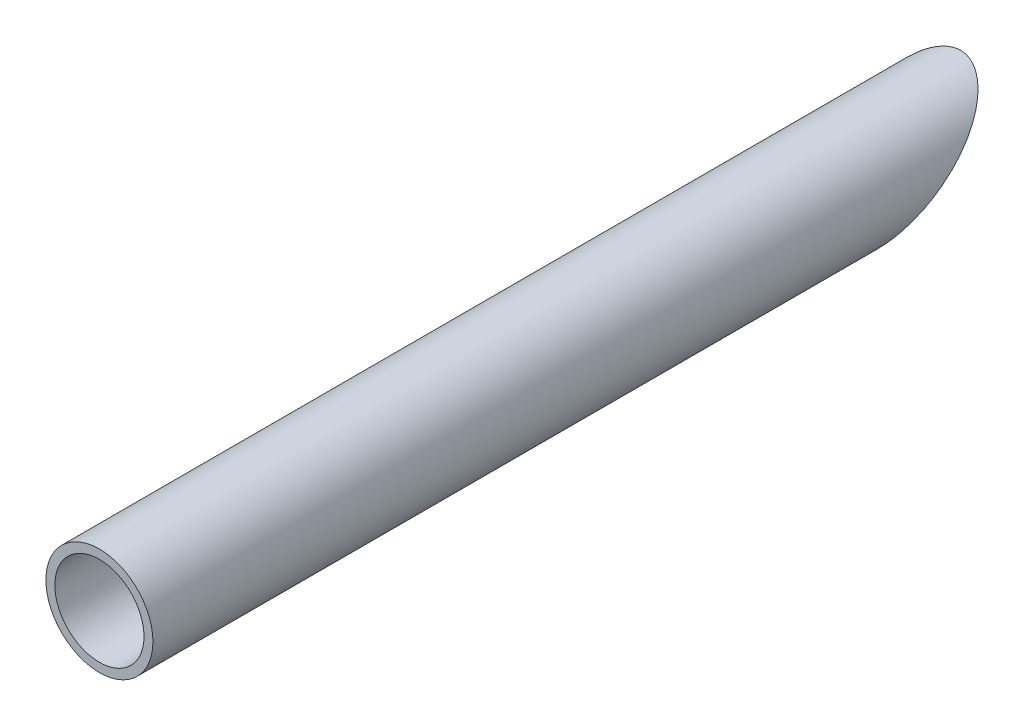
from build123d import *

# Parameters (mm, degrees)
SKIZZE1_R                       = 30
SKIZZE1_R_2                     = 25
AUFSATZ_LINEAR_AUSTRAGEN1_DEPTH = 500


with BuildPart() as part:
    # Skizze1 → Aufsatz-Linear austragen1 (new body)
    with BuildSketch(Plane.XY):
        Circle(SKIZZE1_R)
        Circle(SKIZZE1_R_2, mode=Mode.SUBTRACT)
    extrude(amount=-AUFSATZ_LINEAR_AUSTRAGEN1_DEPTH)

    # Oberfl_chenschnitt3
    split(bisect_by=Plane(origin=(8.979377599, -213.250694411, -161.229549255), x_dir=(0.025357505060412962, -0.6022138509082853, 0.7979319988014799), z_dir=(-0.03356889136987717, 0.7972255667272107, 0.6027474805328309)), keep=Keep.TOP)


solid = part.part
